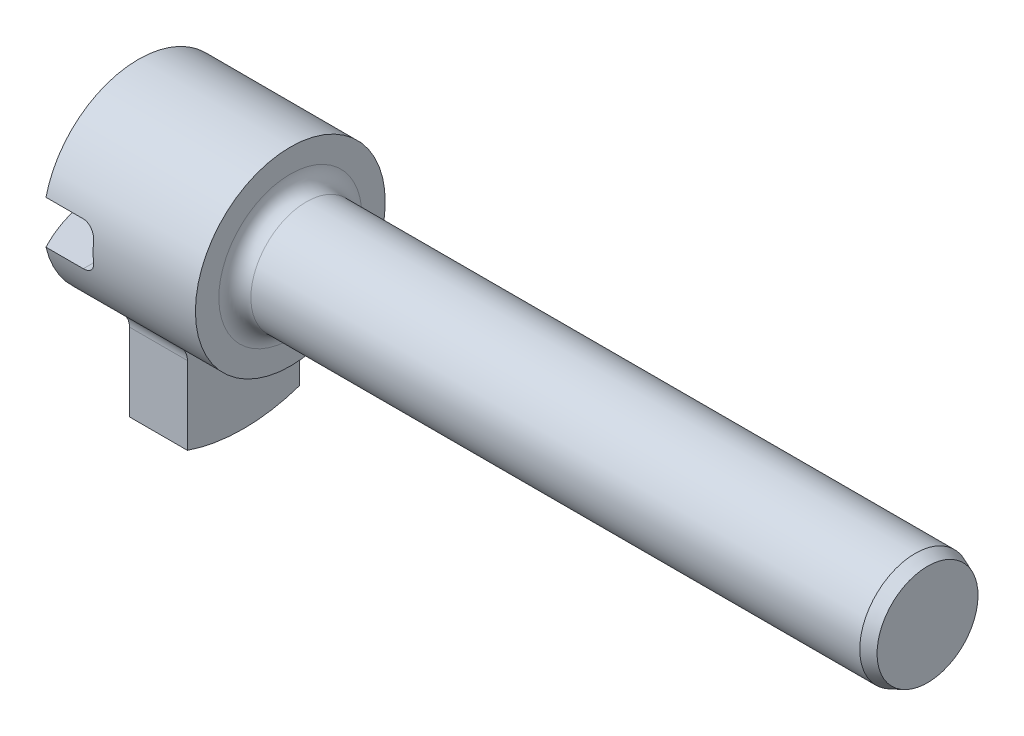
ISO-10303-21;
HEADER;
FILE_DESCRIPTION(('STEP AP214'),'2;1');
FILE_NAME('part.step','',(''),(''),'','','');
FILE_SCHEMA(('AUTOMOTIVE_DESIGN { 1 0 10303 214 1 1 1 1 }'));
ENDSEC;
DATA;
#1=APPLICATION_CONTEXT('core data for automotive mechanical design processes');
#2=APPLICATION_PROTOCOL_DEFINITION('international standard','automotive_design',2000,#1);
#3=PRODUCT_CONTEXT('',#1,'mechanical');
#4=PRODUCT('Part','Part','',(#3));
#5=PRODUCT_RELATED_PRODUCT_CATEGORY('part','',(#4));
#6=PRODUCT_DEFINITION_FORMATION('','',#4);
#7=PRODUCT_DEFINITION_CONTEXT('part definition',#1,'design');
#8=PRODUCT_DEFINITION('design','',#6,#7);
#9=PRODUCT_DEFINITION_SHAPE('','',#8);
#10=(LENGTH_UNIT() NAMED_UNIT(*) SI_UNIT(.MILLI.,.METRE.));
#11=(NAMED_UNIT(*) PLANE_ANGLE_UNIT() SI_UNIT($,.RADIAN.));
#12=(NAMED_UNIT(*) SI_UNIT($,.STERADIAN.) SOLID_ANGLE_UNIT());
#13=UNCERTAINTY_MEASURE_WITH_UNIT(LENGTH_MEASURE(1.E-05),#10,'distance_accuracy_value','');
#14=(GEOMETRIC_REPRESENTATION_CONTEXT(3) GLOBAL_UNCERTAINTY_ASSIGNED_CONTEXT((#13)) GLOBAL_UNIT_ASSIGNED_CONTEXT((#10,
#11,#12)) REPRESENTATION_CONTEXT('',''));
#15=CARTESIAN_POINT('',(0.,0.,0.));
#16=DIRECTION('',(0.,0.,1.));
#17=DIRECTION('',(1.,0.,0.));
#18=AXIS2_PLACEMENT_3D('',#15,#16,#17);
#19=CARTESIAN_POINT('',(0.,0.,0.));
#20=DIRECTION('',(1.,0.,0.));
#21=DIRECTION('',(0.,1.,0.));
#22=AXIS2_PLACEMENT_3D('',#19,#20,#21);
#23=CYLINDRICAL_SURFACE('',#22,1.956);
#24=CARTESIAN_POINT('',(-16.2623250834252,0.,0.));
#25=DIRECTION('',(1.,0.,0.));
#26=DIRECTION('',(0.,1.,0.));
#27=AXIS2_PLACEMENT_3D('',#24,#25,#26);
#28=CIRCLE('',#27,1.956);
#29=CARTESIAN_POINT('',(-16.2623250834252,-0.445000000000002,1.90470758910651));
#30=VERTEX_POINT('',#29);
#31=CARTESIAN_POINT('',(-16.2623250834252,-0.445000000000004,-1.90470758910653));
#32=VERTEX_POINT('',#31);
#33=EDGE_CURVE('E166',#30,#32,#28,.T.);
#34=ORIENTED_EDGE('',*,*,#33,.T.);
#35=DIRECTION('',(1.,0.,0.));
#36=VECTOR('',#35,1.);
#37=CARTESIAN_POINT('',(0.,-0.445000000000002,-1.90470758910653));
#38=LINE('',#37,#36);
#39=CARTESIAN_POINT('',(-15.494,-0.445000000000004,-1.90470758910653));
#40=VERTEX_POINT('',#39);
#41=EDGE_CURVE('E178',#32,#40,#38,.T.);
#42=ORIENTED_EDGE('',*,*,#41,.T.);
#43=CARTESIAN_POINT('',(-15.494,-0.445000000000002,-1.90470758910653));
#44=CARTESIAN_POINT('',(-15.4799366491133,-0.445013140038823,-1.90470007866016));
#45=CARTESIAN_POINT('',(-15.4658803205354,-0.443832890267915,-1.90498021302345));
#46=CARTESIAN_POINT('',(-15.4381952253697,-0.439186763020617,-1.90605905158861));
#47=CARTESIAN_POINT('',(-15.424565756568,-0.435724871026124,-1.90685685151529));
#48=CARTESIAN_POINT('',(-15.3980948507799,-0.426615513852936,-1.90891476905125));
#49=CARTESIAN_POINT('',(-15.3852534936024,-0.42096782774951,-1.91017493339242));
#50=CARTESIAN_POINT('',(-15.3607028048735,-0.407662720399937,-1.91305870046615));
#51=CARTESIAN_POINT('',(-15.3489936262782,-0.400005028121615,-1.91468235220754));
#52=CARTESIAN_POINT('',(-15.3268489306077,-0.382771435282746,-1.9182023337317));
#53=CARTESIAN_POINT('',(-15.3164346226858,-0.373169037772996,-1.92010231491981));
#54=CARTESIAN_POINT('',(-15.2973506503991,-0.352382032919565,-1.92402562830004));
#55=CARTESIAN_POINT('',(-15.2886814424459,-0.341197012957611,-1.92604899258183));
#56=CARTESIAN_POINT('',(-15.2731640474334,-0.317310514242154,-1.93012941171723));
#57=CARTESIAN_POINT('',(-15.2663552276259,-0.30458343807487,-1.93218634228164));
#58=CARTESIAN_POINT('',(-15.2549850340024,-0.278146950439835,-1.9361685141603));
#59=CARTESIAN_POINT('',(-15.250422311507,-0.26443813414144,-1.93809383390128));
#60=CARTESIAN_POINT('',(-15.2447135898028,-0.240721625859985,-1.94115561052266));
#61=CARTESIAN_POINT('',(-15.2429491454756,-0.230866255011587,-1.94235307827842));
#62=CARTESIAN_POINT('',(-15.2405920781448,-0.211011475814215,-1.94461078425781));
#63=CARTESIAN_POINT('',(-15.2399982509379,-0.201012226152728,-1.94567116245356));
#64=CARTESIAN_POINT('',(-15.24,-0.191000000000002,-1.94665225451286));
#65=B_SPLINE_CURVE_WITH_KNOTS('',3,(#43,#44,#45,#46,#47,#48,#49,#50,#51,#52,#53,#54,#55,#56,#57,
#58,#59,#60,#61,#62,#63,#64),.UNSPECIFIED.,.F.,.F.,(4,2,2,2,2,2,2,2,2,2,4),(0.,
0.0421271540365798,0.0841809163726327,0.126238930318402,0.168302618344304,0.210983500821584,
0.253675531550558,0.29721113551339,0.340720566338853,0.370904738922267,0.40105784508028),.UNSPECIFIED.);
#66=CARTESIAN_POINT('',(-15.24,-0.191000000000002,-1.94665225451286));
#67=VERTEX_POINT('',#66);
#68=EDGE_CURVE('E191',#40,#67,#65,.T.);
#69=ORIENTED_EDGE('',*,*,#68,.T.);
#70=CARTESIAN_POINT('',(-15.24,0.,0.));
#71=DIRECTION('',(-1.,0.,0.));
#72=DIRECTION('',(0.,0.,1.));
#73=AXIS2_PLACEMENT_3D('',#70,#71,#72);
#74=CIRCLE('',#73,1.956);
#75=CARTESIAN_POINT('',(-15.24,0.190999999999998,-1.94665225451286));
#76=VERTEX_POINT('',#75);
#77=EDGE_CURVE('E174',#67,#76,#74,.F.);
#78=ORIENTED_EDGE('',*,*,#77,.T.);
#79=CARTESIAN_POINT('',(-15.24,0.190999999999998,-1.94665225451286));
#80=CARTESIAN_POINT('',(-15.2399885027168,0.205393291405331,-1.94524612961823));
#81=CARTESIAN_POINT('',(-15.2412225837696,0.219762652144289,-1.94366916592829));
#82=CARTESIAN_POINT('',(-15.2460767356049,0.248044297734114,-1.94025934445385));
#83=CARTESIAN_POINT('',(-15.2496939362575,0.2619571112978,-1.93842679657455));
#84=CARTESIAN_POINT('',(-15.2592102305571,0.288954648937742,-1.9345875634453));
#85=CARTESIAN_POINT('',(-15.2651096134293,0.302039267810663,-1.93258085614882));
#86=CARTESIAN_POINT('',(-15.2790174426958,0.327025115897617,-1.92850992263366));
#87=CARTESIAN_POINT('',(-15.2870259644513,0.338926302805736,-1.92644569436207));
#88=CARTESIAN_POINT('',(-15.3050078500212,0.361310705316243,-1.92237388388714));
#89=CARTESIAN_POINT('',(-15.3149963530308,0.371781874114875,-1.92036688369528));
#90=CARTESIAN_POINT('',(-15.3366300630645,0.390897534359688,-1.91656732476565));
#91=CARTESIAN_POINT('',(-15.348275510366,0.399541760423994,-1.91477479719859));
#92=CARTESIAN_POINT('',(-15.3728354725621,0.414701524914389,-1.9115487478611));
#93=CARTESIAN_POINT('',(-15.3857428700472,0.421228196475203,-1.91011335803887));
#94=CARTESIAN_POINT('',(-15.4125107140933,0.432004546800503,-1.90770511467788));
#95=CARTESIAN_POINT('',(-15.4263703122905,0.436256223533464,-1.90673185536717));
#96=CARTESIAN_POINT('',(-15.4492771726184,0.441193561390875,-1.90559385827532));
#97=CARTESIAN_POINT('',(-15.4581633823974,0.442619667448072,-1.90526256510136));
#98=CARTESIAN_POINT('',(-15.4760315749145,0.444522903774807,-1.90481906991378));
#99=CARTESIAN_POINT('',(-15.4850134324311,0.445001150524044,-1.90470661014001));
#100=CARTESIAN_POINT('',(-15.494,0.444999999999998,-1.90470758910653));
#101=B_SPLINE_CURVE_WITH_KNOTS('',3,(#79,#80,#81,#82,#83,#84,#85,#86,#87,#88,#89,#90,#91,#92,
#93,#94,#95,#96,#97,#98,#99,#100),.UNSPECIFIED.,.F.,.F.,(4,2,2,2,2,2,2,2,2,2,4),(0.,
0.0433215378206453,0.086590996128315,0.129865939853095,0.173142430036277,0.216763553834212,
0.260391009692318,0.303785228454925,0.347141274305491,0.374110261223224,0.401047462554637),.UNSPECIFIED.);
#102=CARTESIAN_POINT('',(-15.494,0.444999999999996,-1.90470758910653));
#103=VERTEX_POINT('',#102);
#104=EDGE_CURVE('E220',#76,#103,#101,.T.);
#105=ORIENTED_EDGE('',*,*,#104,.T.);
#106=DIRECTION('',(1.,0.,0.));
#107=VECTOR('',#106,1.);
#108=CARTESIAN_POINT('',(0.,0.444999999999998,-1.90470758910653));
#109=LINE('',#108,#107);
#110=CARTESIAN_POINT('',(-16.2623250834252,0.444999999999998,-1.90470758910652));
#111=VERTEX_POINT('',#110);
#112=EDGE_CURVE('E176',#103,#111,#109,.F.);
#113=ORIENTED_EDGE('',*,*,#112,.T.);
#114=CARTESIAN_POINT('',(-16.2623250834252,0.444999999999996,1.90470758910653));
#115=VERTEX_POINT('',#114);
#116=EDGE_CURVE('E163',#111,#115,#28,.T.);
#117=ORIENTED_EDGE('',*,*,#116,.T.);
#118=DIRECTION('',(1.,0.,0.));
#119=VECTOR('',#118,1.);
#120=CARTESIAN_POINT('',(0.,0.444999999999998,1.90470758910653));
#121=LINE('',#120,#119);
#122=CARTESIAN_POINT('',(-15.494,0.444999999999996,1.90470758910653));
#123=VERTEX_POINT('',#122);
#124=EDGE_CURVE('E167',#115,#123,#121,.T.);
#125=ORIENTED_EDGE('',*,*,#124,.T.);
#126=CARTESIAN_POINT('',(-15.494,0.444999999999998,1.90470758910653));
#127=CARTESIAN_POINT('',(-15.4799366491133,0.445013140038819,1.90470007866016));
#128=CARTESIAN_POINT('',(-15.4658803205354,0.443832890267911,1.90498021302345));
#129=CARTESIAN_POINT('',(-15.4381952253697,0.439186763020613,1.90605905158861));
#130=CARTESIAN_POINT('',(-15.424565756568,0.43572487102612,1.90685685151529));
#131=CARTESIAN_POINT('',(-15.3980948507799,0.426615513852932,1.90891476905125));
#132=CARTESIAN_POINT('',(-15.3852534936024,0.420967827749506,1.91017493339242));
#133=CARTESIAN_POINT('',(-15.3607028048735,0.407662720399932,1.91305870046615));
#134=CARTESIAN_POINT('',(-15.3489936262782,0.400005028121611,1.91468235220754));
#135=CARTESIAN_POINT('',(-15.3268489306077,0.382771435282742,1.9182023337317));
#136=CARTESIAN_POINT('',(-15.3164346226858,0.373169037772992,1.92010231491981));
#137=CARTESIAN_POINT('',(-15.2973506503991,0.352382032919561,1.92402562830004));
#138=CARTESIAN_POINT('',(-15.2886814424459,0.341197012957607,1.92604899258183));
#139=CARTESIAN_POINT('',(-15.2731640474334,0.31731051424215,1.93012941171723));
#140=CARTESIAN_POINT('',(-15.2663552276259,0.304583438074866,1.93218634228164));
#141=CARTESIAN_POINT('',(-15.2549850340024,0.278146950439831,1.9361685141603));
#142=CARTESIAN_POINT('',(-15.250422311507,0.264438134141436,1.93809383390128));
#143=CARTESIAN_POINT('',(-15.2447135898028,0.240721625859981,1.94115561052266));
#144=CARTESIAN_POINT('',(-15.2429491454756,0.230866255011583,1.94235307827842));
#145=CARTESIAN_POINT('',(-15.2405920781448,0.211011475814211,1.94461078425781));
#146=CARTESIAN_POINT('',(-15.2399982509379,0.201012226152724,1.94567116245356));
#147=CARTESIAN_POINT('',(-15.24,0.190999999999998,1.94665225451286));
#148=B_SPLINE_CURVE_WITH_KNOTS('',3,(#126,#127,#128,#129,#130,#131,#132,#133,#134,#135,#136,
#137,#138,#139,#140,#141,#142,#143,#144,#145,#146,#147),.UNSPECIFIED.,.F.,.F.,(4,2,2,2,2,2,2,2,
2,2,4),(0.,0.0421271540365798,0.0841809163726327,0.126238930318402,0.168302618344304,
0.210983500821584,0.253675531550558,0.29721113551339,0.340720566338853,0.370904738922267,
0.40105784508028),.UNSPECIFIED.);
#149=CARTESIAN_POINT('',(-15.24,0.190999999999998,1.94665225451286));
#150=VERTEX_POINT('',#149);
#151=EDGE_CURVE('E224',#123,#150,#148,.T.);
#152=ORIENTED_EDGE('',*,*,#151,.T.);
#153=CARTESIAN_POINT('',(-15.24,-0.191000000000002,1.94665225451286));
#154=VERTEX_POINT('',#153);
#155=EDGE_CURVE('E170',#150,#154,#74,.F.);
#156=ORIENTED_EDGE('',*,*,#155,.T.);
#157=CARTESIAN_POINT('',(-15.24,-0.191000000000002,1.94665225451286));
#158=CARTESIAN_POINT('',(-15.2399885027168,-0.205393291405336,1.94524612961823));
#159=CARTESIAN_POINT('',(-15.2412225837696,-0.219762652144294,1.9436691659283));
#160=CARTESIAN_POINT('',(-15.2460767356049,-0.248044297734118,1.94025934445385));
#161=CARTESIAN_POINT('',(-15.2496939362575,-0.261957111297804,1.93842679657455));
#162=CARTESIAN_POINT('',(-15.2592102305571,-0.288954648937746,1.9345875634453));
#163=CARTESIAN_POINT('',(-15.2651096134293,-0.302039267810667,1.93258085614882));
#164=CARTESIAN_POINT('',(-15.2790174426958,-0.327025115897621,1.92850992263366));
#165=CARTESIAN_POINT('',(-15.2870259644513,-0.33892630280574,1.92644569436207));
#166=CARTESIAN_POINT('',(-15.3050078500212,-0.361310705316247,1.92237388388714));
#167=CARTESIAN_POINT('',(-15.3149963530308,-0.371781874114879,1.92036688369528));
#168=CARTESIAN_POINT('',(-15.3366300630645,-0.390897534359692,1.91656732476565));
#169=CARTESIAN_POINT('',(-15.348275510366,-0.399541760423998,1.91477479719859));
#170=CARTESIAN_POINT('',(-15.3728354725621,-0.414701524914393,1.9115487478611));
#171=CARTESIAN_POINT('',(-15.3857428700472,-0.421228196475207,1.91011335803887));
#172=CARTESIAN_POINT('',(-15.4125107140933,-0.432004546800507,1.90770511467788));
#173=CARTESIAN_POINT('',(-15.4263703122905,-0.436256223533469,1.90673185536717));
#174=CARTESIAN_POINT('',(-15.4492771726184,-0.441193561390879,1.90559385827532));
#175=CARTESIAN_POINT('',(-15.4581633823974,-0.442619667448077,1.90526256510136));
#176=CARTESIAN_POINT('',(-15.4760315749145,-0.444522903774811,1.90481906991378));
#177=CARTESIAN_POINT('',(-15.4850134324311,-0.445001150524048,1.90470661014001));
#178=CARTESIAN_POINT('',(-15.494,-0.445000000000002,1.90470758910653));
#179=B_SPLINE_CURVE_WITH_KNOTS('',3,(#157,#158,#159,#160,#161,#162,#163,#164,#165,#166,#167,
#168,#169,#170,#171,#172,#173,#174,#175,#176,#177,#178),.UNSPECIFIED.,.F.,.F.,(4,2,2,2,2,2,2,2,
2,2,4),(0.,0.0433215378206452,0.086590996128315,0.129865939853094,0.173142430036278,
0.216763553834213,0.260391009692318,0.303785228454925,0.347141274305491,0.374110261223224,
0.401047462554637),.UNSPECIFIED.);
#180=CARTESIAN_POINT('',(-15.494,-0.445000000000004,1.90470758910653));
#181=VERTEX_POINT('',#180);
#182=EDGE_CURVE('E198',#154,#181,#179,.T.);
#183=ORIENTED_EDGE('',*,*,#182,.T.);
#184=DIRECTION('',(1.,0.,0.));
#185=VECTOR('',#184,1.);
#186=CARTESIAN_POINT('',(0.,-0.445000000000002,1.90470758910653));
#187=LINE('',#186,#185);
#188=EDGE_CURVE('E173',#181,#30,#187,.F.);
#189=ORIENTED_EDGE('',*,*,#188,.T.);
#190=EDGE_LOOP('',(#34,#42,#69,#78,#105,#113,#117,#125,#152,#156,#183,#189));
#191=FACE_BOUND('',#190,.T.);
#192=CARTESIAN_POINT('',(-13.132,0.,0.));
#193=DIRECTION('',(1.,0.,0.));
#194=DIRECTION('',(0.,1.,0.));
#195=AXIS2_PLACEMENT_3D('',#192,#193,#194);
#196=CIRCLE('',#195,1.956);
#197=CARTESIAN_POINT('',(-13.132,1.956,0.));
#198=VERTEX_POINT('',#197);
#199=EDGE_CURVE('E160',#198,#198,#196,.T.);
#200=ORIENTED_EDGE('',*,*,#199,.F.);
#201=EDGE_LOOP('',(#200));
#202=FACE_BOUND('',#201,.T.);
#203=CARTESIAN_POINT('',(-14.0972,0.,0.));
#204=DIRECTION('',(-1.,0.,0.));
#205=DIRECTION('',(0.,1.,0.));
#206=AXIS2_PLACEMENT_3D('',#203,#204,#205);
#207=CIRCLE('',#206,1.956);
#208=CARTESIAN_POINT('',(-14.0972,-1.47344842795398,-1.28642362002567));
#209=VERTEX_POINT('',#208);
#210=CARTESIAN_POINT('',(-14.0972,-1.47344842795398,1.28642362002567));
#211=VERTEX_POINT('',#210);
#212=EDGE_CURVE('E145',#209,#211,#207,.T.);
#213=ORIENTED_EDGE('',*,*,#212,.F.);
#214=DIRECTION('',(1.,0.,0.));
#215=VECTOR('',#214,1.);
#216=CARTESIAN_POINT('',(0.,-1.47344842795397,-1.28642362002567));
#217=LINE('',#216,#215);
#218=CARTESIAN_POINT('',(-15.291,-1.47344842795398,-1.28642362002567));
#219=VERTEX_POINT('',#218);
#220=EDGE_CURVE('E448',#209,#219,#217,.F.);
#221=ORIENTED_EDGE('',*,*,#220,.T.);
#222=CARTESIAN_POINT('',(-15.291,0.,0.));
#223=DIRECTION('',(-1.,0.,0.));
#224=DIRECTION('',(0.,1.,0.));
#225=AXIS2_PLACEMENT_3D('',#222,#223,#224);
#226=CIRCLE('',#225,1.956);
#227=CARTESIAN_POINT('',(-15.291,-1.47344842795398,1.28642362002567));
#228=VERTEX_POINT('',#227);
#229=EDGE_CURVE('E128',#219,#228,#226,.T.);
#230=ORIENTED_EDGE('',*,*,#229,.T.);
#231=DIRECTION('',(1.,0.,0.));
#232=VECTOR('',#231,1.);
#233=CARTESIAN_POINT('',(0.,-1.47344842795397,1.28642362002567));
#234=LINE('',#233,#232);
#235=EDGE_CURVE('E444',#228,#211,#234,.T.);
#236=ORIENTED_EDGE('',*,*,#235,.T.);
#237=EDGE_LOOP('',(#213,#221,#230,#236));
#238=FACE_BOUND('',#237,.T.);
#239=ADVANCED_FACE('F31',(#191,#202,#238),#23,.T.);
#240=CARTESIAN_POINT('',(-12.7000000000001,0.,0.));
#241=DIRECTION('',(1.,0.,0.));
#242=DIRECTION('',(0.,1.,0.));
#243=AXIS2_PLACEMENT_3D('',#240,#241,#242);
#244=SPHERICAL_SURFACE('',#243,4.06399999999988);
#245=ORIENTED_EDGE('',*,*,#33,.F.);
#246=CARTESIAN_POINT('',(-12.7000000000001,-0.445000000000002,0.));
#247=DIRECTION('',(0.,1.,0.));
#248=DIRECTION('',(0.,0.,1.));
#249=AXIS2_PLACEMENT_3D('',#246,#247,#248);
#250=CIRCLE('',#249,4.03956321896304);
#251=EDGE_CURVE('E157',#30,#32,#250,.F.);
#252=ORIENTED_EDGE('',*,*,#251,.T.);
#253=EDGE_LOOP('',(#245,#252));
#254=FACE_BOUND('',#253,.T.);
#255=ADVANCED_FACE('F211',(#254),#244,.T.);
#256=ORIENTED_EDGE('',*,*,#116,.F.);
#257=CARTESIAN_POINT('',(-12.7000000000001,0.444999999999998,0.));
#258=DIRECTION('',(0.,-1.,0.));
#259=DIRECTION('',(0.,0.,-1.));
#260=AXIS2_PLACEMENT_3D('',#257,#258,#259);
#261=CIRCLE('',#260,4.03956321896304);
#262=EDGE_CURVE('E153',#111,#115,#261,.F.);
#263=ORIENTED_EDGE('',*,*,#262,.T.);
#264=EDGE_LOOP('',(#256,#263));
#265=FACE_BOUND('',#264,.T.);
#266=ADVANCED_FACE('F333',(#265),#244,.T.);
#267=CARTESIAN_POINT('',(0.,0.,0.));
#268=DIRECTION('',(1.,0.,0.));
#269=DIRECTION('',(0.,1.,0.));
#270=AXIS2_PLACEMENT_3D('',#267,#268,#269);
#271=PLANE('',#270);
#272=CARTESIAN_POINT('',(0.,0.,0.));
#273=DIRECTION('',(1.,0.,0.));
#274=DIRECTION('',(0.,1.,0.));
#275=AXIS2_PLACEMENT_3D('',#272,#273,#274);
#276=CIRCLE('',#275,1.04037733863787);
#277=CARTESIAN_POINT('',(0.,1.04037733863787,0.));
#278=VERTEX_POINT('',#277);
#279=EDGE_CURVE('E255',#278,#278,#276,.T.);
#280=ORIENTED_EDGE('',*,*,#279,.T.);
#281=EDGE_LOOP('',(#280));
#282=FACE_BOUND('',#281,.T.);
#283=ADVANCED_FACE('F277',(#282),#271,.T.);
#284=CARTESIAN_POINT('',(-13.132,1.143,0.));
#285=DIRECTION('',(1.,0.,0.));
#286=DIRECTION('',(0.,1.,0.));
#287=AXIS2_PLACEMENT_3D('',#284,#285,#286);
#288=PLANE('',#287);
#289=CARTESIAN_POINT('',(-13.132,0.,0.));
#290=DIRECTION('',(1.,0.,0.));
#291=DIRECTION('',(0.,1.,0.));
#292=AXIS2_PLACEMENT_3D('',#289,#290,#291);
#293=CIRCLE('',#292,1.4732);
#294=CARTESIAN_POINT('',(-13.132,1.4732,0.));
#295=VERTEX_POINT('',#294);
#296=EDGE_CURVE('E11',#295,#295,#293,.F.);
#297=ORIENTED_EDGE('',*,*,#296,.T.);
#298=EDGE_LOOP('',(#297));
#299=FACE_BOUND('',#298,.T.);
#300=ORIENTED_EDGE('',*,*,#199,.T.);
#301=EDGE_LOOP('',(#300));
#302=FACE_BOUND('',#301,.T.);
#303=ADVANCED_FACE('F213',(#299,#302),#288,.T.);
#304=CARTESIAN_POINT('',(0.,0.,0.));
#305=DIRECTION('',(1.,0.,0.));
#306=DIRECTION('',(0.,1.,0.));
#307=AXIS2_PLACEMENT_3D('',#304,#305,#306);
#308=CYLINDRICAL_SURFACE('',#307,1.143);
#309=CARTESIAN_POINT('',(-12.8018,0.,0.));
#310=DIRECTION('',(1.,0.,0.));
#311=DIRECTION('',(0.,1.,0.));
#312=AXIS2_PLACEMENT_3D('',#309,#310,#311);
#313=CIRCLE('',#312,1.143);
#314=CARTESIAN_POINT('',(-12.8018,1.143,0.));
#315=VERTEX_POINT('',#314);
#316=EDGE_CURVE('E39',#315,#315,#313,.T.);
#317=ORIENTED_EDGE('',*,*,#316,.T.);
#318=EDGE_LOOP('',(#317));
#319=FACE_BOUND('',#318,.T.);
#320=CARTESIAN_POINT('',(-0.254000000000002,0.,0.));
#321=DIRECTION('',(1.,0.,0.));
#322=DIRECTION('',(0.,1.,0.));
#323=AXIS2_PLACEMENT_3D('',#320,#321,#322);
#324=CIRCLE('',#323,1.143);
#325=CARTESIAN_POINT('',(-0.254000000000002,1.143,0.));
#326=VERTEX_POINT('',#325);
#327=EDGE_CURVE('E252',#326,#326,#324,.F.);
#328=ORIENTED_EDGE('',*,*,#327,.T.);
#329=EDGE_LOOP('',(#328));
#330=FACE_BOUND('',#329,.T.);
#331=ADVANCED_FACE('F265',(#319,#330),#308,.T.);
#332=CARTESIAN_POINT('',(-16.7395632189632,-0.445000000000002,10.));
#333=DIRECTION('',(0.,1.,0.));
#334=DIRECTION('',(0.,0.,1.));
#335=AXIS2_PLACEMENT_3D('',#332,#333,#334);
#336=PLANE('',#335);
#337=ORIENTED_EDGE('',*,*,#188,.F.);
#338=DIRECTION('',(0.,0.,-1.));
#339=VECTOR('',#338,1.);
#340=CARTESIAN_POINT('',(-15.494,-0.445000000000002,-1.90470758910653));
#341=LINE('',#340,#339);
#342=EDGE_CURVE('E181',#181,#40,#341,.T.);
#343=ORIENTED_EDGE('',*,*,#342,.T.);
#344=ORIENTED_EDGE('',*,*,#41,.F.);
#345=ORIENTED_EDGE('',*,*,#251,.F.);
#346=EDGE_LOOP('',(#337,#343,#344,#345));
#347=FACE_BOUND('',#346,.T.);
#348=ADVANCED_FACE('F269',(#347),#336,.T.);
#349=CARTESIAN_POINT('',(-16.7395632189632,0.444999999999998,10.));
#350=DIRECTION('',(0.,-1.,0.));
#351=DIRECTION('',(0.,0.,-1.));
#352=AXIS2_PLACEMENT_3D('',#349,#350,#351);
#353=PLANE('',#352);
#354=ORIENTED_EDGE('',*,*,#112,.F.);
#355=DIRECTION('',(0.,0.,-1.));
#356=VECTOR('',#355,1.);
#357=CARTESIAN_POINT('',(-15.494,0.444999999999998,1.90470758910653));
#358=LINE('',#357,#356);
#359=EDGE_CURVE('E189',#103,#123,#358,.F.);
#360=ORIENTED_EDGE('',*,*,#359,.T.);
#361=ORIENTED_EDGE('',*,*,#124,.F.);
#362=ORIENTED_EDGE('',*,*,#262,.F.);
#363=EDGE_LOOP('',(#354,#360,#361,#362));
#364=FACE_BOUND('',#363,.T.);
#365=ADVANCED_FACE('F274',(#364),#353,.T.);
#366=CARTESIAN_POINT('',(-15.24,0.444999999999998,0.));
#367=DIRECTION('',(-1.,0.,0.));
#368=DIRECTION('',(0.,-1.,0.));
#369=AXIS2_PLACEMENT_3D('',#366,#367,#368);
#370=PLANE('',#369);
#371=ORIENTED_EDGE('',*,*,#77,.F.);
#372=DIRECTION('',(0.,0.,-1.));
#373=VECTOR('',#372,1.);
#374=CARTESIAN_POINT('',(-15.24,-0.191000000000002,1.90470758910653));
#375=LINE('',#374,#373);
#376=EDGE_CURVE('E187',#67,#154,#375,.F.);
#377=ORIENTED_EDGE('',*,*,#376,.T.);
#378=ORIENTED_EDGE('',*,*,#155,.F.);
#379=DIRECTION('',(0.,0.,-1.));
#380=VECTOR('',#379,1.);
#381=CARTESIAN_POINT('',(-15.24,0.190999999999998,-1.90470758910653));
#382=LINE('',#381,#380);
#383=EDGE_CURVE('E184',#150,#76,#382,.T.);
#384=ORIENTED_EDGE('',*,*,#383,.T.);
#385=EDGE_LOOP('',(#371,#377,#378,#384));
#386=FACE_BOUND('',#385,.T.);
#387=ADVANCED_FACE('F282',(#386),#370,.T.);
#388=CARTESIAN_POINT('',(-15.291,-1.57784663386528,-1.156));
#389=DIRECTION('',(0.,0.,-1.));
#390=DIRECTION('',(0.,1.,0.));
#391=AXIS2_PLACEMENT_3D('',#388,#389,#390);
#392=PLANE('',#391);
#393=DIRECTION('',(0.,1.,0.));
#394=VECTOR('',#393,1.);
#395=CARTESIAN_POINT('',(-15.291,-1.57784663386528,-1.156));
#396=LINE('',#395,#394);
#397=CARTESIAN_POINT('',(-15.291,-3.36285592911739,-1.156));
#398=VERTEX_POINT('',#397);
#399=CARTESIAN_POINT('',(-15.291,-1.76045448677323,-1.156));
#400=VERTEX_POINT('',#399);
#401=EDGE_CURVE('E137',#398,#400,#396,.T.);
#402=ORIENTED_EDGE('',*,*,#401,.T.);
#403=DIRECTION('',(-1.,0.,0.));
#404=VECTOR('',#403,1.);
#405=CARTESIAN_POINT('',(-14.0972,-1.76045448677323,-1.156));
#406=LINE('',#405,#404);
#407=CARTESIAN_POINT('',(-14.0972,-1.76045448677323,-1.156));
#408=VERTEX_POINT('',#407);
#409=EDGE_CURVE('E442',#400,#408,#406,.F.);
#410=ORIENTED_EDGE('',*,*,#409,.T.);
#411=DIRECTION('',(0.,1.,0.));
#412=VECTOR('',#411,1.);
#413=CARTESIAN_POINT('',(-14.0972,-1.57784663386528,-1.156));
#414=LINE('',#413,#412);
#415=CARTESIAN_POINT('',(-14.0972,-3.36285592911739,-1.156));
#416=VERTEX_POINT('',#415);
#417=EDGE_CURVE('E150',#416,#408,#414,.T.);
#418=ORIENTED_EDGE('',*,*,#417,.F.);
#419=DIRECTION('',(1.,0.,0.));
#420=VECTOR('',#419,1.);
#421=CARTESIAN_POINT('',(-15.291,-3.36285592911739,-1.156));
#422=LINE('',#421,#420);
#423=EDGE_CURVE('E136',#398,#416,#422,.T.);
#424=ORIENTED_EDGE('',*,*,#423,.F.);
#425=EDGE_LOOP('',(#402,#410,#418,#424));
#426=FACE_BOUND('',#425,.T.);
#427=ADVANCED_FACE('F288',(#426),#392,.T.);
#428=CARTESIAN_POINT('',(-15.291,0.,0.));
#429=DIRECTION('',(1.,0.,0.));
#430=DIRECTION('',(0.,1.,0.));
#431=AXIS2_PLACEMENT_3D('',#428,#429,#430);
#432=CYLINDRICAL_SURFACE('',#431,3.556);
#433=CARTESIAN_POINT('',(-14.0972,0.,0.));
#434=DIRECTION('',(1.,0.,0.));
#435=DIRECTION('',(0.,1.,0.));
#436=AXIS2_PLACEMENT_3D('',#433,#434,#435);
#437=CIRCLE('',#436,3.556);
#438=CARTESIAN_POINT('',(-14.0972,-3.36285592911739,1.156));
#439=VERTEX_POINT('',#438);
#440=EDGE_CURVE('E135',#439,#416,#437,.T.);
#441=ORIENTED_EDGE('',*,*,#440,.F.);
#442=DIRECTION('',(1.,0.,0.));
#443=VECTOR('',#442,1.);
#444=CARTESIAN_POINT('',(-15.291,-3.36285592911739,1.156));
#445=LINE('',#444,#443);
#446=CARTESIAN_POINT('',(-15.291,-3.36285592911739,1.156));
#447=VERTEX_POINT('',#446);
#448=EDGE_CURVE('E121',#447,#439,#445,.T.);
#449=ORIENTED_EDGE('',*,*,#448,.F.);
#450=CARTESIAN_POINT('',(-15.291,0.,0.));
#451=DIRECTION('',(1.,0.,0.));
#452=DIRECTION('',(0.,1.,0.));
#453=AXIS2_PLACEMENT_3D('',#450,#451,#452);
#454=CIRCLE('',#453,3.556);
#455=EDGE_CURVE('E127',#447,#398,#454,.T.);
#456=ORIENTED_EDGE('',*,*,#455,.T.);
#457=ORIENTED_EDGE('',*,*,#423,.T.);
#458=EDGE_LOOP('',(#441,#449,#456,#457));
#459=FACE_BOUND('',#458,.T.);
#460=ADVANCED_FACE('F132',(#459),#432,.T.);
#461=CARTESIAN_POINT('',(-15.291,-1.57784663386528,1.156));
#462=DIRECTION('',(0.,0.,1.));
#463=DIRECTION('',(1.,0.,0.));
#464=AXIS2_PLACEMENT_3D('',#461,#462,#463);
#465=PLANE('',#464);
#466=DIRECTION('',(0.,-1.,0.));
#467=VECTOR('',#466,1.);
#468=CARTESIAN_POINT('',(-14.0972,-1.57784663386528,1.156));
#469=LINE('',#468,#467);
#470=CARTESIAN_POINT('',(-14.0972,-1.76045448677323,1.156));
#471=VERTEX_POINT('',#470);
#472=EDGE_CURVE('E147',#471,#439,#469,.T.);
#473=ORIENTED_EDGE('',*,*,#472,.F.);
#474=DIRECTION('',(-1.,0.,0.));
#475=VECTOR('',#474,1.);
#476=CARTESIAN_POINT('',(-15.291,-1.76045448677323,1.156));
#477=LINE('',#476,#475);
#478=CARTESIAN_POINT('',(-15.291,-1.76045448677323,1.156));
#479=VERTEX_POINT('',#478);
#480=EDGE_CURVE('E46',#471,#479,#477,.T.);
#481=ORIENTED_EDGE('',*,*,#480,.T.);
#482=DIRECTION('',(0.,-1.,0.));
#483=VECTOR('',#482,1.);
#484=CARTESIAN_POINT('',(-15.291,-1.57784663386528,1.156));
#485=LINE('',#484,#483);
#486=EDGE_CURVE('E118',#479,#447,#485,.T.);
#487=ORIENTED_EDGE('',*,*,#486,.T.);
#488=ORIENTED_EDGE('',*,*,#448,.T.);
#489=EDGE_LOOP('',(#473,#481,#487,#488));
#490=FACE_BOUND('',#489,.T.);
#491=ADVANCED_FACE('F120',(#490),#465,.T.);
#492=CARTESIAN_POINT('',(-15.291,0.,0.));
#493=DIRECTION('',(1.,0.,0.));
#494=DIRECTION('',(0.,1.,0.));
#495=AXIS2_PLACEMENT_3D('',#492,#493,#494);
#496=PLANE('',#495);
#497=ORIENTED_EDGE('',*,*,#229,.F.);
#498=CARTESIAN_POINT('',(-15.291,-1.76045448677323,-1.537));
#499=DIRECTION('',(1.,0.,0.));
#500=DIRECTION('',(0.,1.,0.));
#501=AXIS2_PLACEMENT_3D('',#498,#499,#500);
#502=CIRCLE('',#501,0.381);
#503=EDGE_CURVE('E457',#219,#400,#502,.T.);
#504=ORIENTED_EDGE('',*,*,#503,.T.);
#505=ORIENTED_EDGE('',*,*,#401,.F.);
#506=ORIENTED_EDGE('',*,*,#455,.F.);
#507=ORIENTED_EDGE('',*,*,#486,.F.);
#508=CARTESIAN_POINT('',(-15.291,-1.76045448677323,1.537));
#509=DIRECTION('',(1.,0.,0.));
#510=DIRECTION('',(0.,1.,0.));
#511=AXIS2_PLACEMENT_3D('',#508,#509,#510);
#512=CIRCLE('',#511,0.381);
#513=EDGE_CURVE('E257',#479,#228,#512,.T.);
#514=ORIENTED_EDGE('',*,*,#513,.T.);
#515=EDGE_LOOP('',(#497,#504,#505,#506,#507,#514));
#516=FACE_BOUND('',#515,.T.);
#517=ADVANCED_FACE('F139',(#516),#496,.F.);
#518=CARTESIAN_POINT('',(-14.0972,0.,0.));
#519=DIRECTION('',(1.,0.,0.));
#520=DIRECTION('',(0.,1.,0.));
#521=AXIS2_PLACEMENT_3D('',#518,#519,#520);
#522=PLANE('',#521);
#523=ORIENTED_EDGE('',*,*,#212,.T.);
#524=CARTESIAN_POINT('',(-14.0972,-1.76045448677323,1.537));
#525=DIRECTION('',(1.,0.,0.));
#526=DIRECTION('',(0.,1.,0.));
#527=AXIS2_PLACEMENT_3D('',#524,#525,#526);
#528=CIRCLE('',#527,0.381);
#529=EDGE_CURVE('E54',#211,#471,#528,.F.);
#530=ORIENTED_EDGE('',*,*,#529,.T.);
#531=ORIENTED_EDGE('',*,*,#472,.T.);
#532=ORIENTED_EDGE('',*,*,#440,.T.);
#533=ORIENTED_EDGE('',*,*,#417,.T.);
#534=CARTESIAN_POINT('',(-14.0972,-1.76045448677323,-1.537));
#535=DIRECTION('',(1.,0.,0.));
#536=DIRECTION('',(0.,1.,0.));
#537=AXIS2_PLACEMENT_3D('',#534,#535,#536);
#538=CIRCLE('',#537,0.381);
#539=EDGE_CURVE('E454',#408,#209,#538,.F.);
#540=ORIENTED_EDGE('',*,*,#539,.T.);
#541=EDGE_LOOP('',(#523,#530,#531,#532,#533,#540));
#542=FACE_BOUND('',#541,.T.);
#543=ADVANCED_FACE('F292',(#542),#522,.T.);
#544=CARTESIAN_POINT('',(-15.494,-0.191000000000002,10.));
#545=DIRECTION('',(0.,0.,1.));
#546=DIRECTION('',(1.,0.,0.));
#547=AXIS2_PLACEMENT_3D('',#544,#545,#546);
#548=CYLINDRICAL_SURFACE('',#547,0.254);
#549=ORIENTED_EDGE('',*,*,#182,.F.);
#550=ORIENTED_EDGE('',*,*,#376,.F.);
#551=ORIENTED_EDGE('',*,*,#68,.F.);
#552=ORIENTED_EDGE('',*,*,#342,.F.);
#553=EDGE_LOOP('',(#549,#550,#551,#552));
#554=FACE_BOUND('',#553,.T.);
#555=ADVANCED_FACE('F203',(#554),#548,.F.);
#556=CARTESIAN_POINT('',(-15.494,0.190999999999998,0.));
#557=DIRECTION('',(0.,0.,1.));
#558=DIRECTION('',(1.,0.,0.));
#559=AXIS2_PLACEMENT_3D('',#556,#557,#558);
#560=CYLINDRICAL_SURFACE('',#559,0.254);
#561=ORIENTED_EDGE('',*,*,#151,.F.);
#562=ORIENTED_EDGE('',*,*,#359,.F.);
#563=ORIENTED_EDGE('',*,*,#104,.F.);
#564=ORIENTED_EDGE('',*,*,#383,.F.);
#565=EDGE_LOOP('',(#561,#562,#563,#564));
#566=FACE_BOUND('',#565,.T.);
#567=ADVANCED_FACE('F229',(#566),#560,.F.);
#568=CARTESIAN_POINT('',(0.,-1.76045448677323,-1.537));
#569=DIRECTION('',(1.,0.,0.));
#570=DIRECTION('',(0.,1.,0.));
#571=AXIS2_PLACEMENT_3D('',#568,#569,#570);
#572=CYLINDRICAL_SURFACE('',#571,0.381);
#573=ORIENTED_EDGE('',*,*,#503,.F.);
#574=ORIENTED_EDGE('',*,*,#220,.F.);
#575=ORIENTED_EDGE('',*,*,#539,.F.);
#576=ORIENTED_EDGE('',*,*,#409,.F.);
#577=EDGE_LOOP('',(#573,#574,#575,#576));
#578=FACE_BOUND('',#577,.T.);
#579=ADVANCED_FACE('F233',(#578),#572,.F.);
#580=CARTESIAN_POINT('',(0.,-1.76045448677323,1.537));
#581=DIRECTION('',(1.,0.,0.));
#582=DIRECTION('',(0.,1.,0.));
#583=AXIS2_PLACEMENT_3D('',#580,#581,#582);
#584=CYLINDRICAL_SURFACE('',#583,0.381);
#585=ORIENTED_EDGE('',*,*,#513,.F.);
#586=ORIENTED_EDGE('',*,*,#480,.F.);
#587=ORIENTED_EDGE('',*,*,#529,.F.);
#588=ORIENTED_EDGE('',*,*,#235,.F.);
#589=EDGE_LOOP('',(#585,#586,#587,#588));
#590=FACE_BOUND('',#589,.T.);
#591=ADVANCED_FACE('F238',(#590),#584,.F.);
#592=CARTESIAN_POINT('',(0.,0.,0.));
#593=DIRECTION('',(-1.,0.,0.));
#594=DIRECTION('',(0.,-1.,0.));
#595=AXIS2_PLACEMENT_3D('',#592,#593,#594);
#596=CONICAL_SURFACE('',#595,1.04037733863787,0.383972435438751);
#597=ORIENTED_EDGE('',*,*,#327,.F.);
#598=EDGE_LOOP('',(#597));
#599=FACE_BOUND('',#598,.T.);
#600=ORIENTED_EDGE('',*,*,#279,.F.);
#601=EDGE_LOOP('',(#600));
#602=FACE_BOUND('',#601,.T.);
#603=ADVANCED_FACE('F241',(#599,#602),#596,.T.);
#604=CARTESIAN_POINT('',(-12.8018,0.,0.));
#605=DIRECTION('',(1.,0.,0.));
#606=DIRECTION('',(0.,1.,0.));
#607=AXIS2_PLACEMENT_3D('',#604,#605,#606);
#608=TOROIDAL_SURFACE('',#607,1.4732,0.3302);
#609=ORIENTED_EDGE('',*,*,#296,.F.);
#610=EDGE_LOOP('',(#609));
#611=FACE_BOUND('',#610,.T.);
#612=ORIENTED_EDGE('',*,*,#316,.F.);
#613=EDGE_LOOP('',(#612));
#614=FACE_BOUND('',#613,.T.);
#615=ADVANCED_FACE('F33',(#611,#614),#608,.F.);
#616=CLOSED_SHELL('',(#239,#255,#266,#283,#303,#331,#348,#365,#387,#427,#460,#491,#517,#543,
#555,#567,#579,#591,#603,#615));
#617=MANIFOLD_SOLID_BREP('B2',#616);
#618=ADVANCED_BREP_SHAPE_REPRESENTATION('',(#18,#617),#14);
#619=SHAPE_DEFINITION_REPRESENTATION(#9,#618);
ENDSEC;
END-ISO-10303-21;
